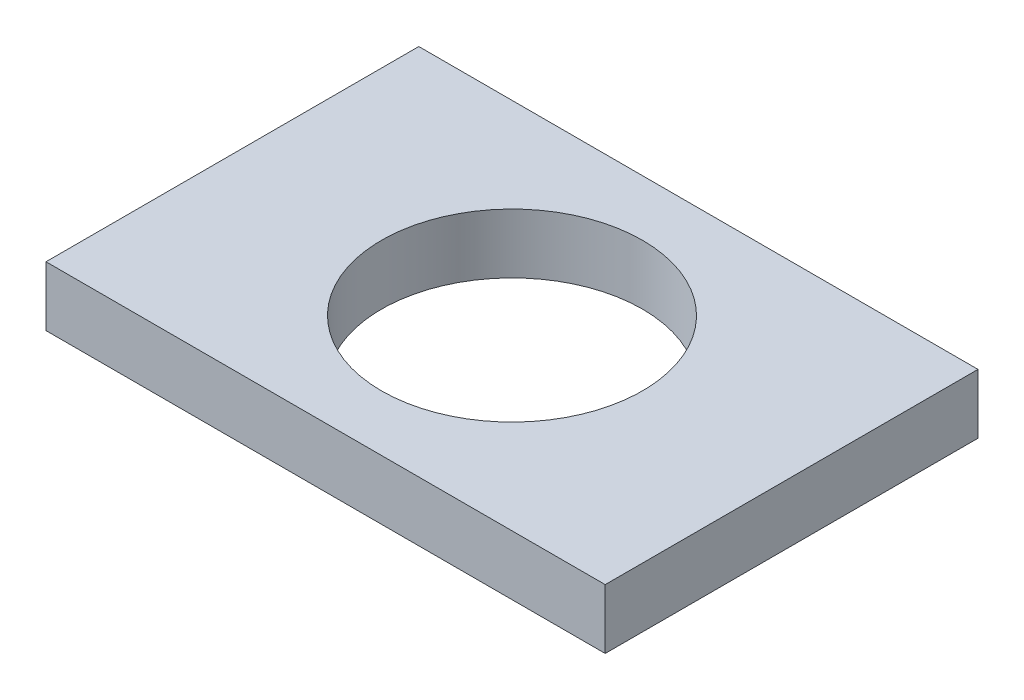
ISO-10303-21;
HEADER;
FILE_DESCRIPTION(('STEP AP214'),'2;1');
FILE_NAME('part.step','',(''),(''),'','','');
FILE_SCHEMA(('AUTOMOTIVE_DESIGN { 1 0 10303 214 1 1 1 1 }'));
ENDSEC;
DATA;
#1=APPLICATION_CONTEXT('core data for automotive mechanical design processes');
#2=APPLICATION_PROTOCOL_DEFINITION('international standard','automotive_design',2000,#1);
#3=PRODUCT_CONTEXT('',#1,'mechanical');
#4=PRODUCT('Part','Part','',(#3));
#5=PRODUCT_RELATED_PRODUCT_CATEGORY('part','',(#4));
#6=PRODUCT_DEFINITION_FORMATION('','',#4);
#7=PRODUCT_DEFINITION_CONTEXT('part definition',#1,'design');
#8=PRODUCT_DEFINITION('design','',#6,#7);
#9=PRODUCT_DEFINITION_SHAPE('','',#8);
#10=(LENGTH_UNIT() NAMED_UNIT(*) SI_UNIT(.MILLI.,.METRE.));
#11=(NAMED_UNIT(*) PLANE_ANGLE_UNIT() SI_UNIT($,.RADIAN.));
#12=(NAMED_UNIT(*) SI_UNIT($,.STERADIAN.) SOLID_ANGLE_UNIT());
#13=UNCERTAINTY_MEASURE_WITH_UNIT(LENGTH_MEASURE(1.E-05),#10,'distance_accuracy_value','');
#14=(GEOMETRIC_REPRESENTATION_CONTEXT(3) GLOBAL_UNCERTAINTY_ASSIGNED_CONTEXT((#13)) GLOBAL_UNIT_ASSIGNED_CONTEXT((#10,
#11,#12)) REPRESENTATION_CONTEXT('',''));
#15=CARTESIAN_POINT('',(0.,0.,0.));
#16=DIRECTION('',(0.,0.,1.));
#17=DIRECTION('',(1.,0.,0.));
#18=AXIS2_PLACEMENT_3D('',#15,#16,#17);
#19=CARTESIAN_POINT('',(-150.,0.,100.));
#20=DIRECTION('',(1.,0.,0.));
#21=DIRECTION('',(0.,0.,-1.));
#22=AXIS2_PLACEMENT_3D('',#19,#20,#21);
#23=PLANE('',#22);
#24=DIRECTION('',(0.,-1.,0.));
#25=VECTOR('',#24,1.);
#26=CARTESIAN_POINT('',(-150.,0.,-100.));
#27=LINE('',#26,#25);
#28=CARTESIAN_POINT('',(-150.,0.,-100.));
#29=VERTEX_POINT('',#28);
#30=CARTESIAN_POINT('',(-150.,-32.,-100.));
#31=VERTEX_POINT('',#30);
#32=EDGE_CURVE('E73',#29,#31,#27,.T.);
#33=ORIENTED_EDGE('',*,*,#32,.T.);
#34=DIRECTION('',(0.,0.,-1.));
#35=VECTOR('',#34,1.);
#36=CARTESIAN_POINT('',(-150.,-32.,100.));
#37=LINE('',#36,#35);
#38=CARTESIAN_POINT('',(-150.,-32.,100.));
#39=VERTEX_POINT('',#38);
#40=EDGE_CURVE('E11',#39,#31,#37,.T.);
#41=ORIENTED_EDGE('',*,*,#40,.F.);
#42=DIRECTION('',(0.,-1.,0.));
#43=VECTOR('',#42,1.);
#44=CARTESIAN_POINT('',(-150.,0.,100.));
#45=LINE('',#44,#43);
#46=CARTESIAN_POINT('',(-150.,0.,100.));
#47=VERTEX_POINT('',#46);
#48=EDGE_CURVE('E96',#47,#39,#45,.T.);
#49=ORIENTED_EDGE('',*,*,#48,.F.);
#50=DIRECTION('',(0.,0.,-1.));
#51=VECTOR('',#50,1.);
#52=CARTESIAN_POINT('',(-150.,0.,100.));
#53=LINE('',#52,#51);
#54=EDGE_CURVE('E85',#47,#29,#53,.T.);
#55=ORIENTED_EDGE('',*,*,#54,.T.);
#56=EDGE_LOOP('',(#33,#41,#49,#55));
#57=FACE_BOUND('',#56,.T.);
#58=ADVANCED_FACE('F29',(#57),#23,.F.);
#59=CARTESIAN_POINT('',(-150.,-32.,100.));
#60=DIRECTION('',(0.,1.,0.));
#61=DIRECTION('',(0.,0.,1.));
#62=AXIS2_PLACEMENT_3D('',#59,#60,#61);
#63=PLANE('',#62);
#64=CARTESIAN_POINT('',(0.,-32.,0.));
#65=DIRECTION('',(0.,1.,0.));
#66=DIRECTION('',(0.,0.,1.));
#67=AXIS2_PLACEMENT_3D('',#64,#65,#66);
#68=CIRCLE('',#67,70.);
#69=CARTESIAN_POINT('',(0.,-32.,70.));
#70=VERTEX_POINT('',#69);
#71=EDGE_CURVE('E86',#70,#70,#68,.T.);
#72=ORIENTED_EDGE('',*,*,#71,.T.);
#73=EDGE_LOOP('',(#72));
#74=FACE_BOUND('',#73,.T.);
#75=DIRECTION('',(1.,0.,0.));
#76=VECTOR('',#75,1.);
#77=CARTESIAN_POINT('',(-150.,-32.,-100.));
#78=LINE('',#77,#76);
#79=CARTESIAN_POINT('',(150.,-32.,-100.));
#80=VERTEX_POINT('',#79);
#81=EDGE_CURVE('E69',#31,#80,#78,.T.);
#82=ORIENTED_EDGE('',*,*,#81,.T.);
#83=DIRECTION('',(0.,0.,-1.));
#84=VECTOR('',#83,1.);
#85=CARTESIAN_POINT('',(150.,-32.,100.));
#86=LINE('',#85,#84);
#87=CARTESIAN_POINT('',(150.,-32.,100.));
#88=VERTEX_POINT('',#87);
#89=EDGE_CURVE('E36',#88,#80,#86,.T.);
#90=ORIENTED_EDGE('',*,*,#89,.F.);
#91=DIRECTION('',(1.,0.,0.));
#92=VECTOR('',#91,1.);
#93=CARTESIAN_POINT('',(-150.,-32.,100.));
#94=LINE('',#93,#92);
#95=EDGE_CURVE('E81',#39,#88,#94,.T.);
#96=ORIENTED_EDGE('',*,*,#95,.F.);
#97=ORIENTED_EDGE('',*,*,#40,.T.);
#98=EDGE_LOOP('',(#82,#90,#96,#97));
#99=FACE_BOUND('',#98,.T.);
#100=ADVANCED_FACE('F80',(#74,#99),#63,.F.);
#101=CARTESIAN_POINT('',(150.,0.,100.));
#102=DIRECTION('',(-1.,0.,0.));
#103=DIRECTION('',(0.,0.,1.));
#104=AXIS2_PLACEMENT_3D('',#101,#102,#103);
#105=PLANE('',#104);
#106=DIRECTION('',(0.,1.,0.));
#107=VECTOR('',#106,1.);
#108=CARTESIAN_POINT('',(150.,0.,-100.));
#109=LINE('',#108,#107);
#110=CARTESIAN_POINT('',(150.,0.,-100.));
#111=VERTEX_POINT('',#110);
#112=EDGE_CURVE('E74',#80,#111,#109,.T.);
#113=ORIENTED_EDGE('',*,*,#112,.T.);
#114=DIRECTION('',(0.,0.,-1.));
#115=VECTOR('',#114,1.);
#116=CARTESIAN_POINT('',(150.,0.,100.));
#117=LINE('',#116,#115);
#118=CARTESIAN_POINT('',(150.,0.,100.));
#119=VERTEX_POINT('',#118);
#120=EDGE_CURVE('E102',#119,#111,#117,.T.);
#121=ORIENTED_EDGE('',*,*,#120,.F.);
#122=DIRECTION('',(0.,1.,0.));
#123=VECTOR('',#122,1.);
#124=CARTESIAN_POINT('',(150.,0.,100.));
#125=LINE('',#124,#123);
#126=EDGE_CURVE('E48',#88,#119,#125,.T.);
#127=ORIENTED_EDGE('',*,*,#126,.F.);
#128=ORIENTED_EDGE('',*,*,#89,.T.);
#129=EDGE_LOOP('',(#113,#121,#127,#128));
#130=FACE_BOUND('',#129,.T.);
#131=ADVANCED_FACE('F105',(#130),#105,.F.);
#132=CARTESIAN_POINT('',(-150.,0.,100.));
#133=DIRECTION('',(0.,-1.,0.));
#134=DIRECTION('',(0.,0.,-1.));
#135=AXIS2_PLACEMENT_3D('',#132,#133,#134);
#136=PLANE('',#135);
#137=CARTESIAN_POINT('',(0.,0.,0.));
#138=DIRECTION('',(0.,1.,0.));
#139=DIRECTION('',(0.,0.,1.));
#140=AXIS2_PLACEMENT_3D('',#137,#138,#139);
#141=CIRCLE('',#140,70.);
#142=CARTESIAN_POINT('',(0.,0.,70.));
#143=VERTEX_POINT('',#142);
#144=EDGE_CURVE('E89',#143,#143,#141,.T.);
#145=ORIENTED_EDGE('',*,*,#144,.F.);
#146=EDGE_LOOP('',(#145));
#147=FACE_BOUND('',#146,.T.);
#148=DIRECTION('',(-1.,0.,0.));
#149=VECTOR('',#148,1.);
#150=CARTESIAN_POINT('',(-150.,0.,-100.));
#151=LINE('',#150,#149);
#152=EDGE_CURVE('E94',#111,#29,#151,.T.);
#153=ORIENTED_EDGE('',*,*,#152,.T.);
#154=ORIENTED_EDGE('',*,*,#54,.F.);
#155=DIRECTION('',(-1.,0.,0.));
#156=VECTOR('',#155,1.);
#157=CARTESIAN_POINT('',(-150.,0.,100.));
#158=LINE('',#157,#156);
#159=EDGE_CURVE('E43',#119,#47,#158,.T.);
#160=ORIENTED_EDGE('',*,*,#159,.F.);
#161=ORIENTED_EDGE('',*,*,#120,.T.);
#162=EDGE_LOOP('',(#153,#154,#160,#161));
#163=FACE_BOUND('',#162,.T.);
#164=ADVANCED_FACE('F107',(#147,#163),#136,.F.);
#165=CARTESIAN_POINT('',(-150.,-32.,100.));
#166=DIRECTION('',(0.,0.,1.));
#167=DIRECTION('',(1.,0.,0.));
#168=AXIS2_PLACEMENT_3D('',#165,#166,#167);
#169=PLANE('',#168);
#170=ORIENTED_EDGE('',*,*,#48,.T.);
#171=ORIENTED_EDGE('',*,*,#95,.T.);
#172=ORIENTED_EDGE('',*,*,#126,.T.);
#173=ORIENTED_EDGE('',*,*,#159,.T.);
#174=EDGE_LOOP('',(#170,#171,#172,#173));
#175=FACE_BOUND('',#174,.T.);
#176=ADVANCED_FACE('F108',(#175),#169,.T.);
#177=CARTESIAN_POINT('',(-150.,-32.,-100.));
#178=DIRECTION('',(0.,0.,1.));
#179=DIRECTION('',(1.,0.,0.));
#180=AXIS2_PLACEMENT_3D('',#177,#178,#179);
#181=PLANE('',#180);
#182=ORIENTED_EDGE('',*,*,#32,.F.);
#183=ORIENTED_EDGE('',*,*,#152,.F.);
#184=ORIENTED_EDGE('',*,*,#112,.F.);
#185=ORIENTED_EDGE('',*,*,#81,.F.);
#186=EDGE_LOOP('',(#182,#183,#184,#185));
#187=FACE_BOUND('',#186,.T.);
#188=ADVANCED_FACE('F70',(#187),#181,.F.);
#189=CARTESIAN_POINT('',(0.,-32.,0.));
#190=DIRECTION('',(0.,1.,0.));
#191=DIRECTION('',(0.,0.,1.));
#192=AXIS2_PLACEMENT_3D('',#189,#190,#191);
#193=CYLINDRICAL_SURFACE('',#192,70.);
#194=ORIENTED_EDGE('',*,*,#71,.F.);
#195=EDGE_LOOP('',(#194));
#196=FACE_BOUND('',#195,.T.);
#197=ORIENTED_EDGE('',*,*,#144,.T.);
#198=EDGE_LOOP('',(#197));
#199=FACE_BOUND('',#198,.T.);
#200=ADVANCED_FACE('F115',(#196,#199),#193,.F.);
#201=CLOSED_SHELL('',(#58,#100,#131,#164,#176,#188,#200));
#202=MANIFOLD_SOLID_BREP('B2',#201);
#203=ADVANCED_BREP_SHAPE_REPRESENTATION('',(#18,#202),#14);
#204=SHAPE_DEFINITION_REPRESENTATION(#9,#203);
ENDSEC;
END-ISO-10303-21;
